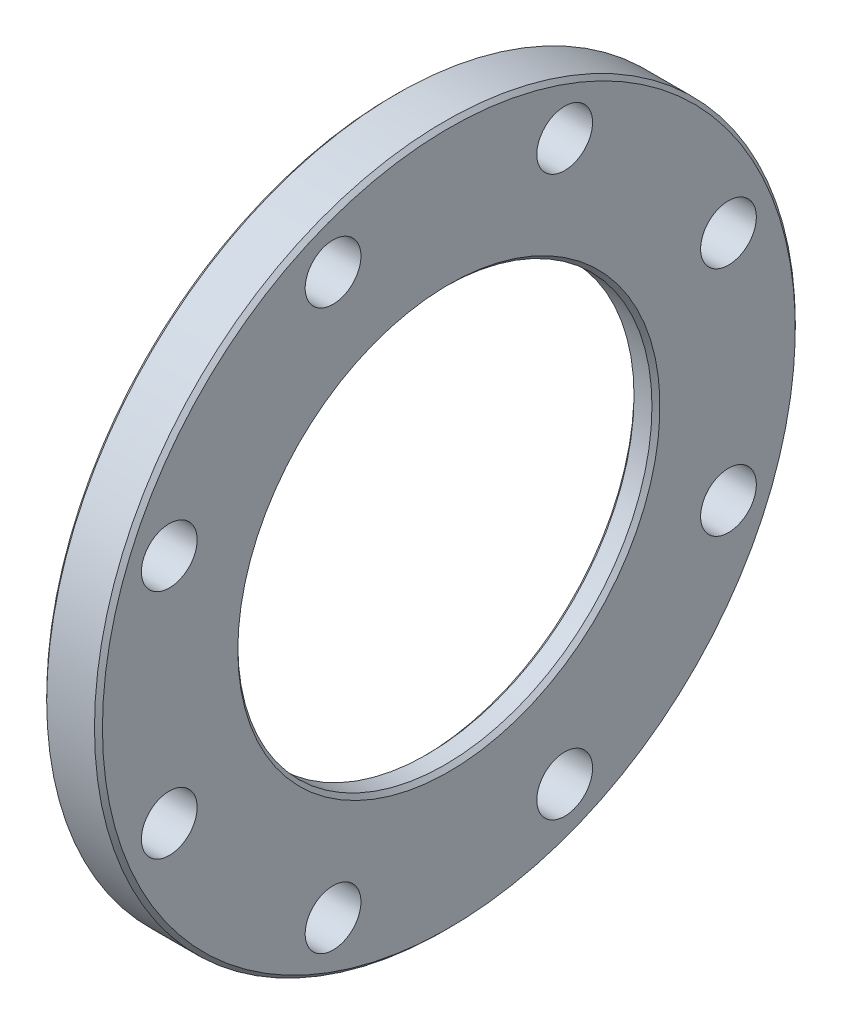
ISO-10303-21;
HEADER;
FILE_DESCRIPTION(('STEP AP214'),'2;1');
FILE_NAME('part.step','',(''),(''),'','','');
FILE_SCHEMA(('AUTOMOTIVE_DESIGN { 1 0 10303 214 1 1 1 1 }'));
ENDSEC;
DATA;
#1=APPLICATION_CONTEXT('core data for automotive mechanical design processes');
#2=APPLICATION_PROTOCOL_DEFINITION('international standard','automotive_design',2000,#1);
#3=PRODUCT_CONTEXT('',#1,'mechanical');
#4=PRODUCT('Part','Part','',(#3));
#5=PRODUCT_RELATED_PRODUCT_CATEGORY('part','',(#4));
#6=PRODUCT_DEFINITION_FORMATION('','',#4);
#7=PRODUCT_DEFINITION_CONTEXT('part definition',#1,'design');
#8=PRODUCT_DEFINITION('design','',#6,#7);
#9=PRODUCT_DEFINITION_SHAPE('','',#8);
#10=(LENGTH_UNIT() NAMED_UNIT(*) SI_UNIT(.MILLI.,.METRE.));
#11=(NAMED_UNIT(*) PLANE_ANGLE_UNIT() SI_UNIT($,.RADIAN.));
#12=(NAMED_UNIT(*) SI_UNIT($,.STERADIAN.) SOLID_ANGLE_UNIT());
#13=UNCERTAINTY_MEASURE_WITH_UNIT(LENGTH_MEASURE(1.E-05),#10,'distance_accuracy_value','');
#14=(GEOMETRIC_REPRESENTATION_CONTEXT(3) GLOBAL_UNCERTAINTY_ASSIGNED_CONTEXT((#13)) GLOBAL_UNIT_ASSIGNED_CONTEXT((#10,
#11,#12)) REPRESENTATION_CONTEXT('',''));
#15=CARTESIAN_POINT('',(0.,0.,0.));
#16=DIRECTION('',(0.,0.,1.));
#17=DIRECTION('',(1.,0.,0.));
#18=AXIS2_PLACEMENT_3D('',#15,#16,#17);
#19=CARTESIAN_POINT('',(22.225,0.,-82.55));
#20=DIRECTION('',(-1.,0.,0.));
#21=DIRECTION('',(0.,0.,1.));
#22=AXIS2_PLACEMENT_3D('',#19,#20,#21);
#23=PLANE('',#22);
#24=CARTESIAN_POINT('',(22.225,0.,0.));
#25=DIRECTION('',(-1.,0.,0.));
#26=DIRECTION('',(0.,0.,1.));
#27=AXIS2_PLACEMENT_3D('',#24,#25,#26);
#28=CIRCLE('',#27,84.1375);
#29=CARTESIAN_POINT('',(22.225,0.,84.1375));
#30=VERTEX_POINT('',#29);
#31=EDGE_CURVE('E42',#30,#30,#28,.T.);
#32=ORIENTED_EDGE('',*,*,#31,.T.);
#33=EDGE_LOOP('',(#32));
#34=FACE_BOUND('',#33,.T.);
#35=CARTESIAN_POINT('',(22.225,0.,0.));
#36=DIRECTION('',(-1.,0.,0.));
#37=DIRECTION('',(0.,0.,1.));
#38=AXIS2_PLACEMENT_3D('',#35,#36,#37);
#39=CIRCLE('',#38,138.1125);
#40=CARTESIAN_POINT('',(22.225,0.,138.1125));
#41=VERTEX_POINT('',#40);
#42=EDGE_CURVE('E46',#41,#41,#39,.F.);
#43=ORIENTED_EDGE('',*,*,#42,.T.);
#44=EDGE_LOOP('',(#43));
#45=FACE_BOUND('',#44,.T.);
#46=CARTESIAN_POINT('',(22.225,111.466065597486,46.1707561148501));
#47=DIRECTION('',(1.,0.,0.));
#48=DIRECTION('',(0.,0.,-1.));
#49=AXIS2_PLACEMENT_3D('',#46,#47,#48);
#50=CIRCLE('',#49,11.1125);
#51=CARTESIAN_POINT('',(22.225,111.466065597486,35.0582561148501));
#52=VERTEX_POINT('',#51);
#53=EDGE_CURVE('E74',#52,#52,#50,.T.);
#54=ORIENTED_EDGE('',*,*,#53,.F.);
#55=EDGE_LOOP('',(#54));
#56=FACE_BOUND('',#55,.T.);
#57=CARTESIAN_POINT('',(22.225,111.466065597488,-46.1707561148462));
#58=DIRECTION('',(1.,0.,0.));
#59=DIRECTION('',(0.,0.,-1.));
#60=AXIS2_PLACEMENT_3D('',#57,#58,#59);
#61=CIRCLE('',#60,11.1125);
#62=CARTESIAN_POINT('',(22.225,111.466065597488,-57.2832561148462));
#63=VERTEX_POINT('',#62);
#64=EDGE_CURVE('E73',#63,#63,#61,.T.);
#65=ORIENTED_EDGE('',*,*,#64,.F.);
#66=EDGE_LOOP('',(#65));
#67=FACE_BOUND('',#66,.T.);
#68=CARTESIAN_POINT('',(22.225,46.1707561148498,-111.466065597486));
#69=DIRECTION('',(1.,0.,0.));
#70=DIRECTION('',(0.,0.,-1.));
#71=AXIS2_PLACEMENT_3D('',#68,#69,#70);
#72=CIRCLE('',#71,11.1125);
#73=CARTESIAN_POINT('',(22.225,46.1707561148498,-122.578565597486));
#74=VERTEX_POINT('',#73);
#75=EDGE_CURVE('E78',#74,#74,#72,.T.);
#76=ORIENTED_EDGE('',*,*,#75,.F.);
#77=EDGE_LOOP('',(#76));
#78=FACE_BOUND('',#77,.T.);
#79=CARTESIAN_POINT('',(22.225,-46.1707561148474,-111.466065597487));
#80=DIRECTION('',(1.,0.,0.));
#81=DIRECTION('',(0.,0.,-1.));
#82=AXIS2_PLACEMENT_3D('',#79,#80,#81);
#83=CIRCLE('',#82,11.1125);
#84=CARTESIAN_POINT('',(22.225,-46.1707561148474,-122.578565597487));
#85=VERTEX_POINT('',#84);
#86=EDGE_CURVE('E82',#85,#85,#83,.T.);
#87=ORIENTED_EDGE('',*,*,#86,.F.);
#88=EDGE_LOOP('',(#87));
#89=FACE_BOUND('',#88,.T.);
#90=CARTESIAN_POINT('',(22.225,-111.466065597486,-46.1707561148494));
#91=DIRECTION('',(1.,0.,0.));
#92=DIRECTION('',(0.,0.,-1.));
#93=AXIS2_PLACEMENT_3D('',#90,#91,#92);
#94=CIRCLE('',#93,11.1125);
#95=CARTESIAN_POINT('',(22.225,-111.466065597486,-57.2832561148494));
#96=VERTEX_POINT('',#95);
#97=EDGE_CURVE('E86',#96,#96,#94,.T.);
#98=ORIENTED_EDGE('',*,*,#97,.F.);
#99=EDGE_LOOP('',(#98));
#100=FACE_BOUND('',#99,.T.);
#101=CARTESIAN_POINT('',(22.225,46.1707561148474,111.466065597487));
#102=DIRECTION('',(1.,0.,0.));
#103=DIRECTION('',(0.,0.,-1.));
#104=AXIS2_PLACEMENT_3D('',#101,#102,#103);
#105=CIRCLE('',#104,11.1125);
#106=CARTESIAN_POINT('',(22.225,46.1707561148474,100.353565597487));
#107=VERTEX_POINT('',#106);
#108=EDGE_CURVE('E92',#107,#107,#105,.T.);
#109=ORIENTED_EDGE('',*,*,#108,.F.);
#110=EDGE_LOOP('',(#109));
#111=FACE_BOUND('',#110,.T.);
#112=CARTESIAN_POINT('',(22.225,-46.170756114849,111.466065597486));
#113=DIRECTION('',(1.,0.,0.));
#114=DIRECTION('',(0.,0.,-1.));
#115=AXIS2_PLACEMENT_3D('',#112,#113,#114);
#116=CIRCLE('',#115,11.1125);
#117=CARTESIAN_POINT('',(22.225,-46.170756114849,100.353565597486));
#118=VERTEX_POINT('',#117);
#119=EDGE_CURVE('E98',#118,#118,#116,.T.);
#120=ORIENTED_EDGE('',*,*,#119,.F.);
#121=EDGE_LOOP('',(#120));
#122=FACE_BOUND('',#121,.T.);
#123=CARTESIAN_POINT('',(22.225,-111.466065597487,46.170756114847));
#124=DIRECTION('',(1.,0.,0.));
#125=DIRECTION('',(0.,0.,-1.));
#126=AXIS2_PLACEMENT_3D('',#123,#124,#125);
#127=CIRCLE('',#126,11.1125);
#128=CARTESIAN_POINT('',(22.225,-111.466065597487,35.058256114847));
#129=VERTEX_POINT('',#128);
#130=EDGE_CURVE('E104',#129,#129,#127,.T.);
#131=ORIENTED_EDGE('',*,*,#130,.F.);
#132=EDGE_LOOP('',(#131));
#133=FACE_BOUND('',#132,.T.);
#134=ADVANCED_FACE('F31',(#34,#45,#56,#67,#78,#89,#100,#111,#122,#133),#23,.F.);
#135=CARTESIAN_POINT('',(0.,0.,0.));
#136=DIRECTION('',(-1.,0.,0.));
#137=DIRECTION('',(0.,0.,1.));
#138=AXIS2_PLACEMENT_3D('',#135,#136,#137);
#139=CYLINDRICAL_SURFACE('',#138,139.7);
#140=CARTESIAN_POINT('',(1.58749999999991,0.,0.));
#141=DIRECTION('',(1.,0.,0.));
#142=DIRECTION('',(0.,0.,-1.));
#143=AXIS2_PLACEMENT_3D('',#140,#141,#142);
#144=CIRCLE('',#143,139.7);
#145=CARTESIAN_POINT('',(1.58749999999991,0.,-139.7));
#146=VERTEX_POINT('',#145);
#147=EDGE_CURVE('E10',#146,#146,#144,.T.);
#148=ORIENTED_EDGE('',*,*,#147,.T.);
#149=EDGE_LOOP('',(#148));
#150=FACE_BOUND('',#149,.T.);
#151=CARTESIAN_POINT('',(20.6375,0.,0.));
#152=DIRECTION('',(-1.,0.,0.));
#153=DIRECTION('',(0.,0.,1.));
#154=AXIS2_PLACEMENT_3D('',#151,#152,#153);
#155=CIRCLE('',#154,139.7);
#156=CARTESIAN_POINT('',(20.6375,0.,139.7));
#157=VERTEX_POINT('',#156);
#158=EDGE_CURVE('E38',#157,#157,#155,.T.);
#159=ORIENTED_EDGE('',*,*,#158,.T.);
#160=EDGE_LOOP('',(#159));
#161=FACE_BOUND('',#160,.T.);
#162=ADVANCED_FACE('F126',(#150,#161),#139,.T.);
#163=CARTESIAN_POINT('',(0.,0.,-139.7));
#164=DIRECTION('',(1.,0.,0.));
#165=DIRECTION('',(0.,0.,-1.));
#166=AXIS2_PLACEMENT_3D('',#163,#164,#165);
#167=PLANE('',#166);
#168=CARTESIAN_POINT('',(0.,0.,0.));
#169=DIRECTION('',(1.,0.,0.));
#170=DIRECTION('',(0.,0.,-1.));
#171=AXIS2_PLACEMENT_3D('',#168,#169,#170);
#172=CIRCLE('',#171,103.98125);
#173=CARTESIAN_POINT('',(0.,0.,-103.98125));
#174=VERTEX_POINT('',#173);
#175=EDGE_CURVE('E60',#174,#174,#172,.T.);
#176=ORIENTED_EDGE('',*,*,#175,.T.);
#177=EDGE_LOOP('',(#176));
#178=FACE_BOUND('',#177,.T.);
#179=CARTESIAN_POINT('',(0.,0.,0.));
#180=DIRECTION('',(1.,0.,0.));
#181=DIRECTION('',(0.,0.,-1.));
#182=AXIS2_PLACEMENT_3D('',#179,#180,#181);
#183=CIRCLE('',#182,138.1125);
#184=CARTESIAN_POINT('',(0.,0.,-138.1125));
#185=VERTEX_POINT('',#184);
#186=EDGE_CURVE('E63',#185,#185,#183,.F.);
#187=ORIENTED_EDGE('',*,*,#186,.T.);
#188=EDGE_LOOP('',(#187));
#189=FACE_BOUND('',#188,.T.);
#190=CARTESIAN_POINT('',(0.,111.466065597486,46.1707561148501));
#191=DIRECTION('',(1.,0.,0.));
#192=DIRECTION('',(0.,0.,-1.));
#193=AXIS2_PLACEMENT_3D('',#190,#191,#192);
#194=CIRCLE('',#193,11.1125);
#195=CARTESIAN_POINT('',(0.,111.466065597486,35.0582561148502));
#196=VERTEX_POINT('',#195);
#197=EDGE_CURVE('E70',#196,#196,#194,.T.);
#198=ORIENTED_EDGE('',*,*,#197,.T.);
#199=EDGE_LOOP('',(#198));
#200=FACE_BOUND('',#199,.T.);
#201=CARTESIAN_POINT('',(0.,111.466065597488,-46.1707561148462));
#202=DIRECTION('',(1.,0.,0.));
#203=DIRECTION('',(0.,0.,-1.));
#204=AXIS2_PLACEMENT_3D('',#201,#202,#203);
#205=CIRCLE('',#204,11.1125);
#206=CARTESIAN_POINT('',(0.,111.466065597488,-57.2832561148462));
#207=VERTEX_POINT('',#206);
#208=EDGE_CURVE('E75',#207,#207,#205,.T.);
#209=ORIENTED_EDGE('',*,*,#208,.T.);
#210=EDGE_LOOP('',(#209));
#211=FACE_BOUND('',#210,.T.);
#212=CARTESIAN_POINT('',(0.,46.1707561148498,-111.466065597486));
#213=DIRECTION('',(1.,0.,0.));
#214=DIRECTION('',(0.,0.,-1.));
#215=AXIS2_PLACEMENT_3D('',#212,#213,#214);
#216=CIRCLE('',#215,11.1125);
#217=CARTESIAN_POINT('',(0.,46.1707561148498,-122.578565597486));
#218=VERTEX_POINT('',#217);
#219=EDGE_CURVE('E79',#218,#218,#216,.T.);
#220=ORIENTED_EDGE('',*,*,#219,.T.);
#221=EDGE_LOOP('',(#220));
#222=FACE_BOUND('',#221,.T.);
#223=CARTESIAN_POINT('',(0.,-46.1707561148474,-111.466065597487));
#224=DIRECTION('',(1.,0.,0.));
#225=DIRECTION('',(0.,0.,-1.));
#226=AXIS2_PLACEMENT_3D('',#223,#224,#225);
#227=CIRCLE('',#226,11.1125);
#228=CARTESIAN_POINT('',(0.,-46.1707561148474,-122.578565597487));
#229=VERTEX_POINT('',#228);
#230=EDGE_CURVE('E83',#229,#229,#227,.T.);
#231=ORIENTED_EDGE('',*,*,#230,.T.);
#232=EDGE_LOOP('',(#231));
#233=FACE_BOUND('',#232,.T.);
#234=CARTESIAN_POINT('',(0.,-111.466065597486,-46.1707561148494));
#235=DIRECTION('',(1.,0.,0.));
#236=DIRECTION('',(0.,0.,-1.));
#237=AXIS2_PLACEMENT_3D('',#234,#235,#236);
#238=CIRCLE('',#237,11.1125);
#239=CARTESIAN_POINT('',(0.,-111.466065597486,-57.2832561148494));
#240=VERTEX_POINT('',#239);
#241=EDGE_CURVE('E107',#240,#240,#238,.T.);
#242=ORIENTED_EDGE('',*,*,#241,.T.);
#243=EDGE_LOOP('',(#242));
#244=FACE_BOUND('',#243,.T.);
#245=CARTESIAN_POINT('',(0.,-111.466065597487,46.170756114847));
#246=DIRECTION('',(1.,0.,0.));
#247=DIRECTION('',(0.,0.,-1.));
#248=AXIS2_PLACEMENT_3D('',#245,#246,#247);
#249=CIRCLE('',#248,11.1125);
#250=CARTESIAN_POINT('',(0.,-111.466065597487,35.058256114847));
#251=VERTEX_POINT('',#250);
#252=EDGE_CURVE('E101',#251,#251,#249,.T.);
#253=ORIENTED_EDGE('',*,*,#252,.T.);
#254=EDGE_LOOP('',(#253));
#255=FACE_BOUND('',#254,.T.);
#256=CARTESIAN_POINT('',(0.,-46.170756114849,111.466065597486));
#257=DIRECTION('',(1.,0.,0.));
#258=DIRECTION('',(0.,0.,-1.));
#259=AXIS2_PLACEMENT_3D('',#256,#257,#258);
#260=CIRCLE('',#259,11.1125);
#261=CARTESIAN_POINT('',(0.,-46.170756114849,100.353565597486));
#262=VERTEX_POINT('',#261);
#263=EDGE_CURVE('E95',#262,#262,#260,.T.);
#264=ORIENTED_EDGE('',*,*,#263,.T.);
#265=EDGE_LOOP('',(#264));
#266=FACE_BOUND('',#265,.T.);
#267=CARTESIAN_POINT('',(0.,46.1707561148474,111.466065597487));
#268=DIRECTION('',(1.,0.,0.));
#269=DIRECTION('',(0.,0.,-1.));
#270=AXIS2_PLACEMENT_3D('',#267,#268,#269);
#271=CIRCLE('',#270,11.1125);
#272=CARTESIAN_POINT('',(0.,46.1707561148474,100.353565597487));
#273=VERTEX_POINT('',#272);
#274=EDGE_CURVE('E89',#273,#273,#271,.T.);
#275=ORIENTED_EDGE('',*,*,#274,.T.);
#276=EDGE_LOOP('',(#275));
#277=FACE_BOUND('',#276,.T.);
#278=ADVANCED_FACE('F151',(#178,#189,#200,#211,#222,#233,#244,#255,#266,#277),#167,.F.);
#279=CARTESIAN_POINT('',(0.,0.,0.));
#280=DIRECTION('',(-1.,0.,0.));
#281=DIRECTION('',(0.,0.,1.));
#282=AXIS2_PLACEMENT_3D('',#279,#280,#281);
#283=CYLINDRICAL_SURFACE('',#282,102.39375);
#284=CARTESIAN_POINT('',(1.58750000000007,0.,0.));
#285=DIRECTION('',(1.,0.,0.));
#286=DIRECTION('',(0.,0.,-1.));
#287=AXIS2_PLACEMENT_3D('',#284,#285,#286);
#288=CIRCLE('',#287,102.39375);
#289=CARTESIAN_POINT('',(1.58750000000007,0.,-102.39375));
#290=VERTEX_POINT('',#289);
#291=EDGE_CURVE('E66',#290,#290,#288,.F.);
#292=ORIENTED_EDGE('',*,*,#291,.T.);
#293=EDGE_LOOP('',(#292));
#294=FACE_BOUND('',#293,.T.);
#295=CARTESIAN_POINT('',(11.90498,0.,0.));
#296=DIRECTION('',(-1.,0.,0.));
#297=DIRECTION('',(0.,0.,1.));
#298=AXIS2_PLACEMENT_3D('',#295,#296,#297);
#299=CIRCLE('',#298,102.39375);
#300=CARTESIAN_POINT('',(11.90498,0.,102.39375));
#301=VERTEX_POINT('',#300);
#302=EDGE_CURVE('E69',#301,#301,#299,.T.);
#303=ORIENTED_EDGE('',*,*,#302,.F.);
#304=EDGE_LOOP('',(#303));
#305=FACE_BOUND('',#304,.T.);
#306=ADVANCED_FACE('F154',(#294,#305),#283,.F.);
#307=CARTESIAN_POINT('',(11.90498,0.,-102.39375));
#308=DIRECTION('',(1.,0.,0.));
#309=DIRECTION('',(0.,0.,-1.));
#310=AXIS2_PLACEMENT_3D('',#307,#308,#309);
#311=PLANE('',#310);
#312=CARTESIAN_POINT('',(11.90498,0.,0.));
#313=DIRECTION('',(1.,0.,0.));
#314=DIRECTION('',(0.,0.,-1.));
#315=AXIS2_PLACEMENT_3D('',#312,#313,#314);
#316=CIRCLE('',#315,84.1375000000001);
#317=CARTESIAN_POINT('',(11.90498,0.,84.1375000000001));
#318=VERTEX_POINT('',#317);
#319=EDGE_CURVE('E51',#318,#318,#316,.T.);
#320=ORIENTED_EDGE('',*,*,#319,.T.);
#321=EDGE_LOOP('',(#320));
#322=FACE_BOUND('',#321,.T.);
#323=ORIENTED_EDGE('',*,*,#302,.T.);
#324=EDGE_LOOP('',(#323));
#325=FACE_BOUND('',#324,.T.);
#326=ADVANCED_FACE('F172',(#322,#325),#311,.F.);
#327=CARTESIAN_POINT('',(0.,0.,0.));
#328=DIRECTION('',(-1.,0.,0.));
#329=DIRECTION('',(0.,0.,1.));
#330=AXIS2_PLACEMENT_3D('',#327,#328,#329);
#331=CYLINDRICAL_SURFACE('',#330,82.55);
#332=CARTESIAN_POINT('',(13.4924800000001,0.,0.));
#333=DIRECTION('',(1.,0.,0.));
#334=DIRECTION('',(0.,0.,-1.));
#335=AXIS2_PLACEMENT_3D('',#332,#333,#334);
#336=CIRCLE('',#335,82.55);
#337=CARTESIAN_POINT('',(13.4924800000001,0.,82.55));
#338=VERTEX_POINT('',#337);
#339=EDGE_CURVE('E54',#338,#338,#336,.F.);
#340=ORIENTED_EDGE('',*,*,#339,.T.);
#341=EDGE_LOOP('',(#340));
#342=FACE_BOUND('',#341,.T.);
#343=CARTESIAN_POINT('',(20.6375,0.,0.));
#344=DIRECTION('',(-1.,0.,0.));
#345=DIRECTION('',(0.,0.,1.));
#346=AXIS2_PLACEMENT_3D('',#343,#344,#345);
#347=CIRCLE('',#346,82.55);
#348=CARTESIAN_POINT('',(20.6375,0.,82.55));
#349=VERTEX_POINT('',#348);
#350=EDGE_CURVE('E57',#349,#349,#347,.F.);
#351=ORIENTED_EDGE('',*,*,#350,.T.);
#352=EDGE_LOOP('',(#351));
#353=FACE_BOUND('',#352,.T.);
#354=ADVANCED_FACE('F163',(#342,#353),#331,.F.);
#355=CARTESIAN_POINT('',(22.225,46.1707561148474,111.466065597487));
#356=DIRECTION('',(1.,0.,0.));
#357=DIRECTION('',(0.,0.,-1.));
#358=AXIS2_PLACEMENT_3D('',#355,#356,#357);
#359=CYLINDRICAL_SURFACE('',#358,11.1125);
#360=ORIENTED_EDGE('',*,*,#108,.T.);
#361=EDGE_LOOP('',(#360));
#362=FACE_BOUND('',#361,.T.);
#363=ORIENTED_EDGE('',*,*,#274,.F.);
#364=EDGE_LOOP('',(#363));
#365=FACE_BOUND('',#364,.T.);
#366=ADVANCED_FACE('F161',(#362,#365),#359,.F.);
#367=CARTESIAN_POINT('',(22.225,-46.170756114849,111.466065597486));
#368=DIRECTION('',(1.,0.,0.));
#369=DIRECTION('',(0.,0.,-1.));
#370=AXIS2_PLACEMENT_3D('',#367,#368,#369);
#371=CYLINDRICAL_SURFACE('',#370,11.1125);
#372=ORIENTED_EDGE('',*,*,#119,.T.);
#373=EDGE_LOOP('',(#372));
#374=FACE_BOUND('',#373,.T.);
#375=ORIENTED_EDGE('',*,*,#263,.F.);
#376=EDGE_LOOP('',(#375));
#377=FACE_BOUND('',#376,.T.);
#378=ADVANCED_FACE('F147',(#374,#377),#371,.F.);
#379=CARTESIAN_POINT('',(22.225,-111.466065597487,46.170756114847));
#380=DIRECTION('',(1.,0.,0.));
#381=DIRECTION('',(0.,0.,-1.));
#382=AXIS2_PLACEMENT_3D('',#379,#380,#381);
#383=CYLINDRICAL_SURFACE('',#382,11.1125);
#384=ORIENTED_EDGE('',*,*,#130,.T.);
#385=EDGE_LOOP('',(#384));
#386=FACE_BOUND('',#385,.T.);
#387=ORIENTED_EDGE('',*,*,#252,.F.);
#388=EDGE_LOOP('',(#387));
#389=FACE_BOUND('',#388,.T.);
#390=ADVANCED_FACE('F143',(#386,#389),#383,.F.);
#391=CARTESIAN_POINT('',(22.225,-111.466065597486,-46.1707561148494));
#392=DIRECTION('',(1.,0.,0.));
#393=DIRECTION('',(0.,0.,-1.));
#394=AXIS2_PLACEMENT_3D('',#391,#392,#393);
#395=CYLINDRICAL_SURFACE('',#394,11.1125);
#396=ORIENTED_EDGE('',*,*,#97,.T.);
#397=EDGE_LOOP('',(#396));
#398=FACE_BOUND('',#397,.T.);
#399=ORIENTED_EDGE('',*,*,#241,.F.);
#400=EDGE_LOOP('',(#399));
#401=FACE_BOUND('',#400,.T.);
#402=ADVANCED_FACE('F146',(#398,#401),#395,.F.);
#403=CARTESIAN_POINT('',(22.225,-46.1707561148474,-111.466065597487));
#404=DIRECTION('',(1.,0.,0.));
#405=DIRECTION('',(0.,0.,-1.));
#406=AXIS2_PLACEMENT_3D('',#403,#404,#405);
#407=CYLINDRICAL_SURFACE('',#406,11.1125);
#408=ORIENTED_EDGE('',*,*,#86,.T.);
#409=EDGE_LOOP('',(#408));
#410=FACE_BOUND('',#409,.T.);
#411=ORIENTED_EDGE('',*,*,#230,.F.);
#412=EDGE_LOOP('',(#411));
#413=FACE_BOUND('',#412,.T.);
#414=ADVANCED_FACE('F217',(#410,#413),#407,.F.);
#415=CARTESIAN_POINT('',(22.225,46.1707561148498,-111.466065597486));
#416=DIRECTION('',(1.,0.,0.));
#417=DIRECTION('',(0.,0.,-1.));
#418=AXIS2_PLACEMENT_3D('',#415,#416,#417);
#419=CYLINDRICAL_SURFACE('',#418,11.1125);
#420=ORIENTED_EDGE('',*,*,#75,.T.);
#421=EDGE_LOOP('',(#420));
#422=FACE_BOUND('',#421,.T.);
#423=ORIENTED_EDGE('',*,*,#219,.F.);
#424=EDGE_LOOP('',(#423));
#425=FACE_BOUND('',#424,.T.);
#426=ADVANCED_FACE('F223',(#422,#425),#419,.F.);
#427=CARTESIAN_POINT('',(22.225,111.466065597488,-46.1707561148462));
#428=DIRECTION('',(1.,0.,0.));
#429=DIRECTION('',(0.,0.,-1.));
#430=AXIS2_PLACEMENT_3D('',#427,#428,#429);
#431=CYLINDRICAL_SURFACE('',#430,11.1125);
#432=ORIENTED_EDGE('',*,*,#64,.T.);
#433=EDGE_LOOP('',(#432));
#434=FACE_BOUND('',#433,.T.);
#435=ORIENTED_EDGE('',*,*,#208,.F.);
#436=EDGE_LOOP('',(#435));
#437=FACE_BOUND('',#436,.T.);
#438=ADVANCED_FACE('F229',(#434,#437),#431,.F.);
#439=CARTESIAN_POINT('',(22.225,111.466065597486,46.1707561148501));
#440=DIRECTION('',(1.,0.,0.));
#441=DIRECTION('',(0.,0.,-1.));
#442=AXIS2_PLACEMENT_3D('',#439,#440,#441);
#443=CYLINDRICAL_SURFACE('',#442,11.1125);
#444=ORIENTED_EDGE('',*,*,#53,.T.);
#445=EDGE_LOOP('',(#444));
#446=FACE_BOUND('',#445,.T.);
#447=ORIENTED_EDGE('',*,*,#197,.F.);
#448=EDGE_LOOP('',(#447));
#449=FACE_BOUND('',#448,.T.);
#450=ADVANCED_FACE('F121',(#446,#449),#443,.F.);
#451=CARTESIAN_POINT('',(1.58750000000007,0.,0.));
#452=DIRECTION('',(-1.,0.,0.));
#453=DIRECTION('',(0.,0.,1.));
#454=AXIS2_PLACEMENT_3D('',#451,#452,#453);
#455=CONICAL_SURFACE('',#454,102.39375,0.78539816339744);
#456=ORIENTED_EDGE('',*,*,#175,.F.);
#457=EDGE_LOOP('',(#456));
#458=FACE_BOUND('',#457,.T.);
#459=ORIENTED_EDGE('',*,*,#291,.F.);
#460=EDGE_LOOP('',(#459));
#461=FACE_BOUND('',#460,.T.);
#462=ADVANCED_FACE('F184',(#458,#461),#455,.F.);
#463=CARTESIAN_POINT('',(13.4924800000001,0.,0.));
#464=DIRECTION('',(-1.,0.,0.));
#465=DIRECTION('',(0.,0.,1.));
#466=AXIS2_PLACEMENT_3D('',#463,#464,#465);
#467=CONICAL_SURFACE('',#466,82.55,0.785398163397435);
#468=CARTESIAN_POINT('',(11.90498,0.,84.1375000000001));
#469=CARTESIAN_POINT('',(11.9215164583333,0.,84.1209635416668));
#470=CARTESIAN_POINT('',(11.9380529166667,0.,84.1044270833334));
#471=CARTESIAN_POINT('',(11.9711258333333,0.,84.0713541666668));
#472=CARTESIAN_POINT('',(11.9876622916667,0.,84.0548177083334));
#473=CARTESIAN_POINT('',(12.0207352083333,0.,84.0217447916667));
#474=CARTESIAN_POINT('',(12.0372716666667,0.,84.0052083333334));
#475=CARTESIAN_POINT('',(12.0703445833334,0.,83.9721354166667));
#476=CARTESIAN_POINT('',(12.0868810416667,0.,83.9555989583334));
#477=CARTESIAN_POINT('',(12.1199539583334,0.,83.9225260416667));
#478=CARTESIAN_POINT('',(12.1364904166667,0.,83.9059895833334));
#479=CARTESIAN_POINT('',(12.1695633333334,0.,83.8729166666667));
#480=CARTESIAN_POINT('',(12.1860997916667,0.,83.8563802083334));
#481=CARTESIAN_POINT('',(12.2191727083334,0.,83.8233072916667));
#482=CARTESIAN_POINT('',(12.2357091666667,0.,83.8067708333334));
#483=CARTESIAN_POINT('',(12.2687820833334,0.,83.7736979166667));
#484=CARTESIAN_POINT('',(12.2853185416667,0.,83.7571614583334));
#485=CARTESIAN_POINT('',(12.3183914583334,0.,83.7240885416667));
#486=CARTESIAN_POINT('',(12.3349279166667,0.,83.7075520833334));
#487=CARTESIAN_POINT('',(12.3680008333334,0.,83.6744791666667));
#488=CARTESIAN_POINT('',(12.3845372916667,0.,83.6579427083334));
#489=CARTESIAN_POINT('',(12.4176102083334,0.,83.6248697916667));
#490=CARTESIAN_POINT('',(12.4341466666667,0.,83.6083333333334));
#491=CARTESIAN_POINT('',(12.4672195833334,0.,83.5752604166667));
#492=CARTESIAN_POINT('',(12.4837560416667,0.,83.5587239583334));
#493=CARTESIAN_POINT('',(12.5168289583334,0.,83.5256510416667));
#494=CARTESIAN_POINT('',(12.5333654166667,0.,83.5091145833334));
#495=CARTESIAN_POINT('',(12.5664383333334,0.,83.4760416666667));
#496=CARTESIAN_POINT('',(12.5829747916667,0.,83.4595052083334));
#497=CARTESIAN_POINT('',(12.6160477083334,0.,83.4264322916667));
#498=CARTESIAN_POINT('',(12.6325841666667,0.,83.4098958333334));
#499=CARTESIAN_POINT('',(12.6656570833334,0.,83.3768229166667));
#500=CARTESIAN_POINT('',(12.6821935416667,0.,83.3602864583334));
#501=CARTESIAN_POINT('',(12.7152664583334,0.,83.3272135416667));
#502=CARTESIAN_POINT('',(12.7318029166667,0.,83.3106770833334));
#503=CARTESIAN_POINT('',(12.7648758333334,0.,83.2776041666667));
#504=CARTESIAN_POINT('',(12.7814122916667,0.,83.2610677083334));
#505=CARTESIAN_POINT('',(12.8144852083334,0.,83.2279947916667));
#506=CARTESIAN_POINT('',(12.8310216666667,0.,83.2114583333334));
#507=CARTESIAN_POINT('',(12.8640945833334,0.,83.1783854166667));
#508=CARTESIAN_POINT('',(12.8806310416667,0.,83.1618489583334));
#509=CARTESIAN_POINT('',(12.9137039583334,0.,83.1287760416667));
#510=CARTESIAN_POINT('',(12.9302404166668,0.,83.1122395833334));
#511=CARTESIAN_POINT('',(12.9633133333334,0.,83.0791666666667));
#512=CARTESIAN_POINT('',(12.9798497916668,0.,83.0626302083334));
#513=CARTESIAN_POINT('',(13.0129227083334,0.,83.0295572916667));
#514=CARTESIAN_POINT('',(13.0294591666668,0.,83.0130208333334));
#515=CARTESIAN_POINT('',(13.0625320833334,0.,82.9799479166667));
#516=CARTESIAN_POINT('',(13.0790685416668,0.,82.9634114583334));
#517=CARTESIAN_POINT('',(13.1121414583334,0.,82.9303385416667));
#518=CARTESIAN_POINT('',(13.1286779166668,0.,82.9138020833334));
#519=CARTESIAN_POINT('',(13.1617508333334,0.,82.8807291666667));
#520=CARTESIAN_POINT('',(13.1782872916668,0.,82.8641927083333));
#521=CARTESIAN_POINT('',(13.2113602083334,0.,82.8311197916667));
#522=CARTESIAN_POINT('',(13.2278966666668,0.,82.8145833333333));
#523=CARTESIAN_POINT('',(13.2609695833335,0.,82.7815104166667));
#524=CARTESIAN_POINT('',(13.2775060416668,0.,82.7649739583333));
#525=CARTESIAN_POINT('',(13.3105789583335,0.,82.7319010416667));
#526=CARTESIAN_POINT('',(13.3271154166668,0.,82.7153645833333));
#527=CARTESIAN_POINT('',(13.3601883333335,0.,82.6822916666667));
#528=CARTESIAN_POINT('',(13.3767247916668,0.,82.6657552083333));
#529=CARTESIAN_POINT('',(13.4097977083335,0.,82.6326822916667));
#530=CARTESIAN_POINT('',(13.4263341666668,0.,82.6161458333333));
#531=CARTESIAN_POINT('',(13.4594070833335,0.,82.5830729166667));
#532=CARTESIAN_POINT('',(13.4759435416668,0.,82.5665364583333));
#533=CARTESIAN_POINT('',(13.4924800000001,0.,82.55));
#534=B_SPLINE_CURVE_WITH_KNOTS('',3,(#468,#469,#470,#471,#472,#473,#474,#475,#476,#477,#478,
#479,#480,#481,#482,#483,#484,#485,#486,#487,#488,#489,#490,#491,#492,#493,#494,#495,#496,#497,
#498,#499,#500,#501,#502,#503,#504,#505,#506,#507,#508,#509,#510,#511,#512,#513,#514,#515,#516,
#517,#518,#519,#520,#521,#522,#523,#524,#525,#526,#527,#528,#529,#530,#531,#532,#533),
.UNSPECIFIED.,.F.,.F.,(4,2,2,2,2,2,2,2,2,2,2,2,2,2,2,2,2,2,2,2,2,2,2,2,2,2,2,2,2,2,2,2,4),(0.,
0.0701582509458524,0.140316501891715,0.210474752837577,0.280633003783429,0.350791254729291,
0.420949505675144,0.491107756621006,0.561266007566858,0.631424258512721,0.701582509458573,
0.771740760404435,0.841899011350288,0.91205726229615,0.982215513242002,1.05237376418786,
1.12253201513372,1.19269026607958,1.26284851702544,1.33300676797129,1.40316501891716,
1.47332326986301,1.54348152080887,1.61363977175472,1.68379802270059,1.75395627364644,
1.8241145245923,1.89427277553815,1.96443102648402,2.03458927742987,2.10474752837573,
2.17490577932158,2.24506403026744),.UNSPECIFIED.);
#535=EDGE_CURVE('BSEAM187',#318,#338,#534,.T.);
#536=ORIENTED_EDGE('',*,*,#319,.F.);
#537=ORIENTED_EDGE('',*,*,#339,.F.);
#538=ORIENTED_EDGE('',*,*,#535,.T.);
#539=ORIENTED_EDGE('',*,*,#535,.F.);
#540=EDGE_LOOP('',(#536,#538,#537,#539));
#541=FACE_BOUND('',#540,.T.);
#542=ADVANCED_FACE('F187',(#541),#467,.F.);
#543=CARTESIAN_POINT('',(22.225,0.,0.));
#544=DIRECTION('',(1.,0.,0.));
#545=DIRECTION('',(0.,0.,-1.));
#546=AXIS2_PLACEMENT_3D('',#543,#544,#545);
#547=CONICAL_SURFACE('',#546,84.1375,0.785398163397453);
#548=ORIENTED_EDGE('',*,*,#350,.F.);
#549=EDGE_LOOP('',(#548));
#550=FACE_BOUND('',#549,.T.);
#551=ORIENTED_EDGE('',*,*,#31,.F.);
#552=EDGE_LOOP('',(#551));
#553=FACE_BOUND('',#552,.T.);
#554=ADVANCED_FACE('F191',(#550,#553),#547,.F.);
#555=CARTESIAN_POINT('',(0.,0.,0.));
#556=DIRECTION('',(1.,0.,0.));
#557=DIRECTION('',(0.,0.,-1.));
#558=AXIS2_PLACEMENT_3D('',#555,#556,#557);
#559=CONICAL_SURFACE('',#558,138.1125,0.785398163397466);
#560=CARTESIAN_POINT('',(1.58749999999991,0.,-139.7));
#561=CARTESIAN_POINT('',(1.57096354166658,0.,-139.683463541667));
#562=CARTESIAN_POINT('',(1.55442708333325,0.,-139.666927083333));
#563=CARTESIAN_POINT('',(1.52135416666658,0.,-139.633854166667));
#564=CARTESIAN_POINT('',(1.50481770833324,0.,-139.617317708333));
#565=CARTESIAN_POINT('',(1.47174479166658,0.,-139.584244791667));
#566=CARTESIAN_POINT('',(1.45520833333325,0.,-139.567708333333));
#567=CARTESIAN_POINT('',(1.42213541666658,0.,-139.534635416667));
#568=CARTESIAN_POINT('',(1.40559895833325,0.,-139.518098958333));
#569=CARTESIAN_POINT('',(1.37252604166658,0.,-139.485026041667));
#570=CARTESIAN_POINT('',(1.35598958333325,0.,-139.468489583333));
#571=CARTESIAN_POINT('',(1.32291666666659,0.,-139.435416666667));
#572=CARTESIAN_POINT('',(1.30638020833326,0.,-139.418880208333));
#573=CARTESIAN_POINT('',(1.27330729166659,0.,-139.385807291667));
#574=CARTESIAN_POINT('',(1.25677083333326,0.,-139.369270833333));
#575=CARTESIAN_POINT('',(1.22369791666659,0.,-139.336197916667));
#576=CARTESIAN_POINT('',(1.20716145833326,0.,-139.319661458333));
#577=CARTESIAN_POINT('',(1.1740885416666,0.,-139.286588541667));
#578=CARTESIAN_POINT('',(1.15755208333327,0.,-139.270052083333));
#579=CARTESIAN_POINT('',(1.1244791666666,0.,-139.236979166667));
#580=CARTESIAN_POINT('',(1.10794270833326,0.,-139.220442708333));
#581=CARTESIAN_POINT('',(1.0748697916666,0.,-139.187369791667));
#582=CARTESIAN_POINT('',(1.05833333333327,0.,-139.170833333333));
#583=CARTESIAN_POINT('',(1.02526041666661,0.,-139.137760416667));
#584=CARTESIAN_POINT('',(1.00872395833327,0.,-139.121223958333));
#585=CARTESIAN_POINT('',(0.975651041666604,0.,-139.088151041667));
#586=CARTESIAN_POINT('',(0.959114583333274,0.,-139.071614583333));
#587=CARTESIAN_POINT('',(0.926041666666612,0.,-139.038541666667));
#588=CARTESIAN_POINT('',(0.909505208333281,0.,-139.022005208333));
#589=CARTESIAN_POINT('',(0.876432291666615,0.,-138.988932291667));
#590=CARTESIAN_POINT('',(0.859895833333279,0.,-138.972395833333));
#591=CARTESIAN_POINT('',(0.826822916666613,0.,-138.939322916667));
#592=CARTESIAN_POINT('',(0.810286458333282,0.,-138.922786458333));
#593=CARTESIAN_POINT('',(0.777213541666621,0.,-138.889713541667));
#594=CARTESIAN_POINT('',(0.76067708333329,0.,-138.873177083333));
#595=CARTESIAN_POINT('',(0.727604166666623,0.,-138.840104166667));
#596=CARTESIAN_POINT('',(0.711067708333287,0.,-138.823567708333));
#597=CARTESIAN_POINT('',(0.677994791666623,0.,-138.790494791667));
#598=CARTESIAN_POINT('',(0.661458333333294,0.,-138.773958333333));
#599=CARTESIAN_POINT('',(0.62838541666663,0.,-138.740885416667));
#600=CARTESIAN_POINT('',(0.611848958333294,0.,-138.724348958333));
#601=CARTESIAN_POINT('',(0.578776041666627,0.,-138.691276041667));
#602=CARTESIAN_POINT('',(0.562239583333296,0.,-138.674739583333));
#603=CARTESIAN_POINT('',(0.529166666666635,0.,-138.641666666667));
#604=CARTESIAN_POINT('',(0.512630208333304,0.,-138.625130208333));
#605=CARTESIAN_POINT('',(0.479557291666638,0.,-138.592057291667));
#606=CARTESIAN_POINT('',(0.463020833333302,0.,-138.575520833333));
#607=CARTESIAN_POINT('',(0.429947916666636,0.,-138.542447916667));
#608=CARTESIAN_POINT('',(0.413411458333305,0.,-138.525911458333));
#609=CARTESIAN_POINT('',(0.380338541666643,0.,-138.492838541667));
#610=CARTESIAN_POINT('',(0.363802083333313,0.,-138.476302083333));
#611=CARTESIAN_POINT('',(0.330729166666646,0.,-138.443229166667));
#612=CARTESIAN_POINT('',(0.31419270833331,0.,-138.426692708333));
#613=CARTESIAN_POINT('',(0.281119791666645,0.,-138.393619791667));
#614=CARTESIAN_POINT('',(0.264583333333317,0.,-138.377083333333));
#615=CARTESIAN_POINT('',(0.231510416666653,0.,-138.344010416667));
#616=CARTESIAN_POINT('',(0.214973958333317,0.,-138.327473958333));
#617=CARTESIAN_POINT('',(0.18190104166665,0.,-138.294401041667));
#618=CARTESIAN_POINT('',(0.165364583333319,0.,-138.277864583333));
#619=CARTESIAN_POINT('',(0.132291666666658,0.,-138.244791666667));
#620=CARTESIAN_POINT('',(0.115755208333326,0.,-138.228255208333));
#621=CARTESIAN_POINT('',(0.0826822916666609,0.,-138.195182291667));
#622=CARTESIAN_POINT('',(0.0661458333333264,0.,-138.178645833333));
#623=CARTESIAN_POINT('',(0.0330729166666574,0.,-138.145572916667));
#624=CARTESIAN_POINT('',(0.0165364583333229,0.,-138.129036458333));
#625=CARTESIAN_POINT('',(0.,0.,-138.1125));
#626=B_SPLINE_CURVE_WITH_KNOTS('',3,(#560,#561,#562,#563,#564,#565,#566,#567,#568,#569,#570,
#571,#572,#573,#574,#575,#576,#577,#578,#579,#580,#581,#582,#583,#584,#585,#586,#587,#588,#589,
#590,#591,#592,#593,#594,#595,#596,#597,#598,#599,#600,#601,#602,#603,#604,#605,#606,#607,#608,
#609,#610,#611,#612,#613,#614,#615,#616,#617,#618,#619,#620,#621,#622,#623,#624,#625),
.UNSPECIFIED.,.F.,.F.,(4,2,2,2,2,2,2,2,2,2,2,2,2,2,2,2,2,2,2,2,2,2,2,2,2,2,2,2,2,2,2,2,4),(0.,
0.0701582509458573,0.140316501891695,0.210474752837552,0.28063300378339,0.350791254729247,
0.420949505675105,0.491107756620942,0.5612660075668,0.631424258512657,0.701582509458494,
0.771740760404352,0.84189901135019,0.912057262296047,0.982215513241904,1.05237376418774,
1.1225320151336,1.19269026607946,1.26284851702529,1.33300676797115,1.40316501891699,
1.47332326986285,1.5434815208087,1.61363977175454,1.6837980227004,1.75395627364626,
1.82411452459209,1.89427277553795,1.96443102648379,2.03458927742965,2.1047475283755,
2.17490577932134,2.2450640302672),.UNSPECIFIED.);
#627=EDGE_CURVE('BSEAM194',#146,#185,#626,.T.);
#628=ORIENTED_EDGE('',*,*,#147,.F.);
#629=ORIENTED_EDGE('',*,*,#186,.F.);
#630=ORIENTED_EDGE('',*,*,#627,.T.);
#631=ORIENTED_EDGE('',*,*,#627,.F.);
#632=EDGE_LOOP('',(#628,#630,#629,#631));
#633=FACE_BOUND('',#632,.T.);
#634=ADVANCED_FACE('F194',(#633),#559,.T.);
#635=CARTESIAN_POINT('',(20.6375,0.,0.));
#636=DIRECTION('',(-1.,0.,0.));
#637=DIRECTION('',(0.,0.,1.));
#638=AXIS2_PLACEMENT_3D('',#635,#636,#637);
#639=CONICAL_SURFACE('',#638,139.7,0.785398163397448);
#640=ORIENTED_EDGE('',*,*,#42,.F.);
#641=EDGE_LOOP('',(#640));
#642=FACE_BOUND('',#641,.T.);
#643=ORIENTED_EDGE('',*,*,#158,.F.);
#644=EDGE_LOOP('',(#643));
#645=FACE_BOUND('',#644,.T.);
#646=ADVANCED_FACE('F33',(#642,#645),#639,.T.);
#647=CLOSED_SHELL('',(#134,#162,#278,#306,#326,#354,#366,#378,#390,#402,#414,#426,#438,#450,
#462,#542,#554,#634,#646));
#648=MANIFOLD_SOLID_BREP('B2',#647);
#649=ADVANCED_BREP_SHAPE_REPRESENTATION('',(#18,#648),#14);
#650=SHAPE_DEFINITION_REPRESENTATION(#9,#649);
ENDSEC;
END-ISO-10303-21;
